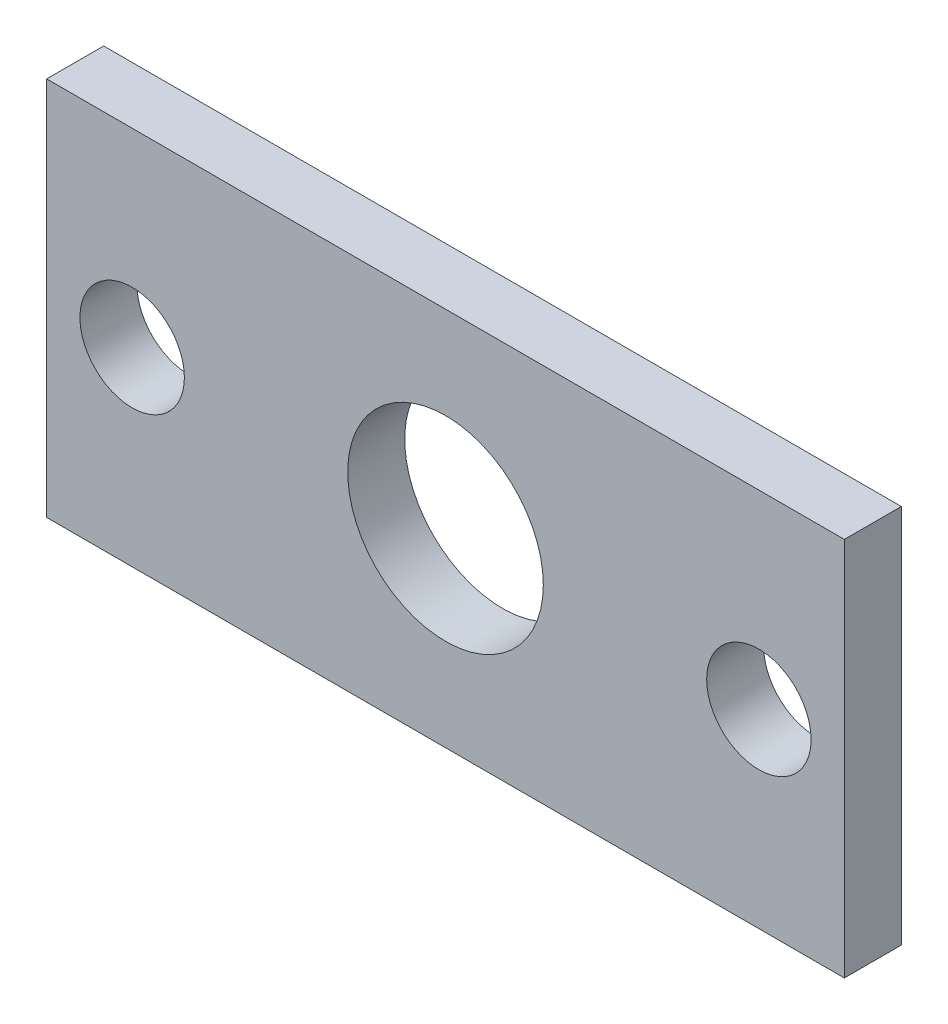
ISO-10303-21;
HEADER;
FILE_DESCRIPTION(('STEP AP214'),'2;1');
FILE_NAME('part.step','',(''),(''),'','','');
FILE_SCHEMA(('AUTOMOTIVE_DESIGN { 1 0 10303 214 1 1 1 1 }'));
ENDSEC;
DATA;
#1=APPLICATION_CONTEXT('core data for automotive mechanical design processes');
#2=APPLICATION_PROTOCOL_DEFINITION('international standard','automotive_design',2000,#1);
#3=PRODUCT_CONTEXT('',#1,'mechanical');
#4=PRODUCT('Part','Part','',(#3));
#5=PRODUCT_RELATED_PRODUCT_CATEGORY('part','',(#4));
#6=PRODUCT_DEFINITION_FORMATION('','',#4);
#7=PRODUCT_DEFINITION_CONTEXT('part definition',#1,'design');
#8=PRODUCT_DEFINITION('design','',#6,#7);
#9=PRODUCT_DEFINITION_SHAPE('','',#8);
#10=(LENGTH_UNIT() NAMED_UNIT(*) SI_UNIT(.MILLI.,.METRE.));
#11=(NAMED_UNIT(*) PLANE_ANGLE_UNIT() SI_UNIT($,.RADIAN.));
#12=(NAMED_UNIT(*) SI_UNIT($,.STERADIAN.) SOLID_ANGLE_UNIT());
#13=UNCERTAINTY_MEASURE_WITH_UNIT(LENGTH_MEASURE(1.E-05),#10,'distance_accuracy_value','');
#14=(GEOMETRIC_REPRESENTATION_CONTEXT(3) GLOBAL_UNCERTAINTY_ASSIGNED_CONTEXT((#13)) GLOBAL_UNIT_ASSIGNED_CONTEXT((#10,
#11,#12)) REPRESENTATION_CONTEXT('',''));
#15=CARTESIAN_POINT('',(0.,0.,0.));
#16=DIRECTION('',(0.,0.,1.));
#17=DIRECTION('',(1.,0.,0.));
#18=AXIS2_PLACEMENT_3D('',#15,#16,#17);
#19=CARTESIAN_POINT('',(-6.87548757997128,12.5582256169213,3.));
#20=DIRECTION('',(1.,0.,0.));
#21=DIRECTION('',(0.,1.,0.));
#22=AXIS2_PLACEMENT_3D('',#19,#20,#21);
#23=PLANE('',#22);
#24=DIRECTION('',(0.,-1.,0.));
#25=VECTOR('',#24,1.);
#26=CARTESIAN_POINT('',(-6.87548757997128,12.5582256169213,0.));
#27=LINE('',#26,#25);
#28=CARTESIAN_POINT('',(-6.87548757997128,12.5582256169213,0.));
#29=VERTEX_POINT('',#28);
#30=CARTESIAN_POINT('',(-6.87548757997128,-7.44177438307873,0.));
#31=VERTEX_POINT('',#30);
#32=EDGE_CURVE('E95',#29,#31,#27,.T.);
#33=ORIENTED_EDGE('',*,*,#32,.T.);
#34=DIRECTION('',(0.,0.,-1.));
#35=VECTOR('',#34,1.);
#36=CARTESIAN_POINT('',(-6.87548757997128,-7.44177438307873,3.));
#37=LINE('',#36,#35);
#38=CARTESIAN_POINT('',(-6.87548757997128,-7.44177438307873,3.));
#39=VERTEX_POINT('',#38);
#40=EDGE_CURVE('E11',#39,#31,#37,.T.);
#41=ORIENTED_EDGE('',*,*,#40,.F.);
#42=DIRECTION('',(0.,-1.,0.));
#43=VECTOR('',#42,1.);
#44=CARTESIAN_POINT('',(-6.87548757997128,12.5582256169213,3.));
#45=LINE('',#44,#43);
#46=CARTESIAN_POINT('',(-6.87548757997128,12.5582256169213,3.));
#47=VERTEX_POINT('',#46);
#48=EDGE_CURVE('E83',#47,#39,#45,.T.);
#49=ORIENTED_EDGE('',*,*,#48,.F.);
#50=DIRECTION('',(0.,0.,-1.));
#51=VECTOR('',#50,1.);
#52=CARTESIAN_POINT('',(-6.87548757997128,12.5582256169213,3.));
#53=LINE('',#52,#51);
#54=EDGE_CURVE('E91',#47,#29,#53,.T.);
#55=ORIENTED_EDGE('',*,*,#54,.T.);
#56=EDGE_LOOP('',(#33,#41,#49,#55));
#57=FACE_BOUND('',#56,.T.);
#58=ADVANCED_FACE('F32',(#57),#23,.F.);
#59=CARTESIAN_POINT('',(-6.87548757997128,-7.44177438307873,3.));
#60=DIRECTION('',(0.,1.,0.));
#61=DIRECTION('',(0.,0.,1.));
#62=AXIS2_PLACEMENT_3D('',#59,#60,#61);
#63=PLANE('',#62);
#64=DIRECTION('',(1.,0.,0.));
#65=VECTOR('',#64,1.);
#66=CARTESIAN_POINT('',(-6.87548757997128,-7.44177438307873,0.));
#67=LINE('',#66,#65);
#68=CARTESIAN_POINT('',(35.1245124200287,-7.44177438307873,0.));
#69=VERTEX_POINT('',#68);
#70=EDGE_CURVE('E87',#31,#69,#67,.T.);
#71=ORIENTED_EDGE('',*,*,#70,.T.);
#72=DIRECTION('',(0.,0.,-1.));
#73=VECTOR('',#72,1.);
#74=CARTESIAN_POINT('',(35.1245124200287,-7.44177438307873,3.));
#75=LINE('',#74,#73);
#76=CARTESIAN_POINT('',(35.1245124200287,-7.44177438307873,3.));
#77=VERTEX_POINT('',#76);
#78=EDGE_CURVE('E40',#77,#69,#75,.T.);
#79=ORIENTED_EDGE('',*,*,#78,.F.);
#80=DIRECTION('',(1.,0.,0.));
#81=VECTOR('',#80,1.);
#82=CARTESIAN_POINT('',(-6.87548757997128,-7.44177438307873,3.));
#83=LINE('',#82,#81);
#84=EDGE_CURVE('E78',#39,#77,#83,.T.);
#85=ORIENTED_EDGE('',*,*,#84,.F.);
#86=ORIENTED_EDGE('',*,*,#40,.T.);
#87=EDGE_LOOP('',(#71,#79,#85,#86));
#88=FACE_BOUND('',#87,.T.);
#89=ADVANCED_FACE('F86',(#88),#63,.F.);
#90=CARTESIAN_POINT('',(35.1245124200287,12.5582256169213,3.));
#91=DIRECTION('',(-1.,0.,0.));
#92=DIRECTION('',(0.,-1.,0.));
#93=AXIS2_PLACEMENT_3D('',#90,#91,#92);
#94=PLANE('',#93);
#95=DIRECTION('',(0.,1.,0.));
#96=VECTOR('',#95,1.);
#97=CARTESIAN_POINT('',(35.1245124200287,12.5582256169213,0.));
#98=LINE('',#97,#96);
#99=CARTESIAN_POINT('',(35.1245124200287,12.5582256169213,0.));
#100=VERTEX_POINT('',#99);
#101=EDGE_CURVE('E65',#69,#100,#98,.T.);
#102=ORIENTED_EDGE('',*,*,#101,.T.);
#103=DIRECTION('',(0.,0.,-1.));
#104=VECTOR('',#103,1.);
#105=CARTESIAN_POINT('',(35.1245124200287,12.5582256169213,3.));
#106=LINE('',#105,#104);
#107=CARTESIAN_POINT('',(35.1245124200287,12.5582256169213,3.));
#108=VERTEX_POINT('',#107);
#109=EDGE_CURVE('E88',#108,#100,#106,.T.);
#110=ORIENTED_EDGE('',*,*,#109,.F.);
#111=DIRECTION('',(0.,1.,0.));
#112=VECTOR('',#111,1.);
#113=CARTESIAN_POINT('',(35.1245124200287,12.5582256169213,3.));
#114=LINE('',#113,#112);
#115=EDGE_CURVE('E81',#77,#108,#114,.T.);
#116=ORIENTED_EDGE('',*,*,#115,.F.);
#117=ORIENTED_EDGE('',*,*,#78,.T.);
#118=EDGE_LOOP('',(#102,#110,#116,#117));
#119=FACE_BOUND('',#118,.T.);
#120=ADVANCED_FACE('F89',(#119),#94,.F.);
#121=CARTESIAN_POINT('',(-6.87548757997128,12.5582256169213,3.));
#122=DIRECTION('',(0.,-1.,0.));
#123=DIRECTION('',(0.,0.,-1.));
#124=AXIS2_PLACEMENT_3D('',#121,#122,#123);
#125=PLANE('',#124);
#126=DIRECTION('',(-1.,0.,0.));
#127=VECTOR('',#126,1.);
#128=CARTESIAN_POINT('',(-6.87548757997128,12.5582256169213,0.));
#129=LINE('',#128,#127);
#130=EDGE_CURVE('E71',#100,#29,#129,.T.);
#131=ORIENTED_EDGE('',*,*,#130,.T.);
#132=ORIENTED_EDGE('',*,*,#54,.F.);
#133=DIRECTION('',(-1.,0.,0.));
#134=VECTOR('',#133,1.);
#135=CARTESIAN_POINT('',(-6.87548757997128,12.5582256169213,3.));
#136=LINE('',#135,#134);
#137=EDGE_CURVE('E48',#108,#47,#136,.T.);
#138=ORIENTED_EDGE('',*,*,#137,.F.);
#139=ORIENTED_EDGE('',*,*,#109,.T.);
#140=EDGE_LOOP('',(#131,#132,#138,#139));
#141=FACE_BOUND('',#140,.T.);
#142=ADVANCED_FACE('F103',(#141),#125,.F.);
#143=CARTESIAN_POINT('',(-6.87548757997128,-7.44177438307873,3.));
#144=DIRECTION('',(0.,0.,1.));
#145=DIRECTION('',(1.,0.,0.));
#146=AXIS2_PLACEMENT_3D('',#143,#144,#145);
#147=PLANE('',#146);
#148=CARTESIAN_POINT('',(14.1245124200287,2.55822561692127,3.));
#149=DIRECTION('',(0.,0.,1.));
#150=DIRECTION('',(1.,0.,0.));
#151=AXIS2_PLACEMENT_3D('',#148,#149,#150);
#152=CIRCLE('',#151,5.15);
#153=CARTESIAN_POINT('',(19.2745124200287,2.55822561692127,3.));
#154=VERTEX_POINT('',#153);
#155=EDGE_CURVE('E121',#154,#154,#152,.T.);
#156=ORIENTED_EDGE('',*,*,#155,.F.);
#157=EDGE_LOOP('',(#156));
#158=FACE_BOUND('',#157,.T.);
#159=CARTESIAN_POINT('',(30.6245124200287,2.55822561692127,3.));
#160=DIRECTION('',(0.,0.,1.));
#161=DIRECTION('',(-1.,0.,0.));
#162=AXIS2_PLACEMENT_3D('',#159,#160,#161);
#163=CIRCLE('',#162,2.75);
#164=CARTESIAN_POINT('',(27.8745124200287,2.55822561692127,3.));
#165=VERTEX_POINT('',#164);
#166=EDGE_CURVE('E115',#165,#165,#163,.T.);
#167=ORIENTED_EDGE('',*,*,#166,.F.);
#168=EDGE_LOOP('',(#167));
#169=FACE_BOUND('',#168,.T.);
#170=CARTESIAN_POINT('',(-2.37548757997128,2.55822561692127,3.));
#171=DIRECTION('',(0.,0.,1.));
#172=DIRECTION('',(1.,0.,0.));
#173=AXIS2_PLACEMENT_3D('',#170,#171,#172);
#174=CIRCLE('',#173,2.75);
#175=CARTESIAN_POINT('',(0.374512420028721,2.55822561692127,3.));
#176=VERTEX_POINT('',#175);
#177=EDGE_CURVE('E109',#176,#176,#174,.T.);
#178=ORIENTED_EDGE('',*,*,#177,.F.);
#179=EDGE_LOOP('',(#178));
#180=FACE_BOUND('',#179,.T.);
#181=ORIENTED_EDGE('',*,*,#48,.T.);
#182=ORIENTED_EDGE('',*,*,#84,.T.);
#183=ORIENTED_EDGE('',*,*,#115,.T.);
#184=ORIENTED_EDGE('',*,*,#137,.T.);
#185=EDGE_LOOP('',(#181,#182,#183,#184));
#186=FACE_BOUND('',#185,.T.);
#187=ADVANCED_FACE('F79',(#158,#169,#180,#186),#147,.T.);
#188=CARTESIAN_POINT('',(-6.87548757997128,-7.44177438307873,0.));
#189=DIRECTION('',(0.,0.,1.));
#190=DIRECTION('',(1.,0.,0.));
#191=AXIS2_PLACEMENT_3D('',#188,#189,#190);
#192=PLANE('',#191);
#193=CARTESIAN_POINT('',(14.1245124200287,2.55822561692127,0.));
#194=DIRECTION('',(0.,0.,1.));
#195=DIRECTION('',(1.,0.,0.));
#196=AXIS2_PLACEMENT_3D('',#193,#194,#195);
#197=CIRCLE('',#196,5.15);
#198=CARTESIAN_POINT('',(19.2745124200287,2.55822561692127,0.));
#199=VERTEX_POINT('',#198);
#200=EDGE_CURVE('E118',#199,#199,#197,.T.);
#201=ORIENTED_EDGE('',*,*,#200,.T.);
#202=EDGE_LOOP('',(#201));
#203=FACE_BOUND('',#202,.T.);
#204=CARTESIAN_POINT('',(30.6245124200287,2.55822561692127,0.));
#205=DIRECTION('',(0.,0.,1.));
#206=DIRECTION('',(-1.,0.,0.));
#207=AXIS2_PLACEMENT_3D('',#204,#205,#206);
#208=CIRCLE('',#207,2.75);
#209=CARTESIAN_POINT('',(27.8745124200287,2.55822561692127,0.));
#210=VERTEX_POINT('',#209);
#211=EDGE_CURVE('E112',#210,#210,#208,.T.);
#212=ORIENTED_EDGE('',*,*,#211,.T.);
#213=EDGE_LOOP('',(#212));
#214=FACE_BOUND('',#213,.T.);
#215=CARTESIAN_POINT('',(-2.37548757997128,2.55822561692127,0.));
#216=DIRECTION('',(0.,0.,1.));
#217=DIRECTION('',(1.,0.,0.));
#218=AXIS2_PLACEMENT_3D('',#215,#216,#217);
#219=CIRCLE('',#218,2.75);
#220=CARTESIAN_POINT('',(0.374512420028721,2.55822561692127,0.));
#221=VERTEX_POINT('',#220);
#222=EDGE_CURVE('E98',#221,#221,#219,.T.);
#223=ORIENTED_EDGE('',*,*,#222,.T.);
#224=EDGE_LOOP('',(#223));
#225=FACE_BOUND('',#224,.T.);
#226=ORIENTED_EDGE('',*,*,#32,.F.);
#227=ORIENTED_EDGE('',*,*,#130,.F.);
#228=ORIENTED_EDGE('',*,*,#101,.F.);
#229=ORIENTED_EDGE('',*,*,#70,.F.);
#230=EDGE_LOOP('',(#226,#227,#228,#229));
#231=FACE_BOUND('',#230,.T.);
#232=ADVANCED_FACE('F106',(#203,#214,#225,#231),#192,.F.);
#233=CARTESIAN_POINT('',(-2.37548757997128,2.55822561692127,0.));
#234=DIRECTION('',(0.,0.,1.));
#235=DIRECTION('',(1.,0.,0.));
#236=AXIS2_PLACEMENT_3D('',#233,#234,#235);
#237=CYLINDRICAL_SURFACE('',#236,2.75);
#238=ORIENTED_EDGE('',*,*,#222,.F.);
#239=EDGE_LOOP('',(#238));
#240=FACE_BOUND('',#239,.T.);
#241=ORIENTED_EDGE('',*,*,#177,.T.);
#242=EDGE_LOOP('',(#241));
#243=FACE_BOUND('',#242,.T.);
#244=ADVANCED_FACE('F143',(#240,#243),#237,.F.);
#245=CARTESIAN_POINT('',(30.6245124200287,2.55822561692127,0.));
#246=DIRECTION('',(0.,0.,1.));
#247=DIRECTION('',(1.,0.,0.));
#248=AXIS2_PLACEMENT_3D('',#245,#246,#247);
#249=CYLINDRICAL_SURFACE('',#248,2.75);
#250=ORIENTED_EDGE('',*,*,#211,.F.);
#251=EDGE_LOOP('',(#250));
#252=FACE_BOUND('',#251,.T.);
#253=ORIENTED_EDGE('',*,*,#166,.T.);
#254=EDGE_LOOP('',(#253));
#255=FACE_BOUND('',#254,.T.);
#256=ADVANCED_FACE('F132',(#252,#255),#249,.F.);
#257=CARTESIAN_POINT('',(14.1245124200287,2.55822561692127,0.));
#258=DIRECTION('',(0.,0.,1.));
#259=DIRECTION('',(1.,0.,0.));
#260=AXIS2_PLACEMENT_3D('',#257,#258,#259);
#261=CYLINDRICAL_SURFACE('',#260,5.15);
#262=ORIENTED_EDGE('',*,*,#200,.F.);
#263=EDGE_LOOP('',(#262));
#264=FACE_BOUND('',#263,.T.);
#265=ORIENTED_EDGE('',*,*,#155,.T.);
#266=EDGE_LOOP('',(#265));
#267=FACE_BOUND('',#266,.T.);
#268=ADVANCED_FACE('F129',(#264,#267),#261,.F.);
#269=CLOSED_SHELL('',(#58,#89,#120,#142,#187,#232,#244,#256,#268));
#270=MANIFOLD_SOLID_BREP('B2',#269);
#271=ADVANCED_BREP_SHAPE_REPRESENTATION('',(#18,#270),#14);
#272=SHAPE_DEFINITION_REPRESENTATION(#9,#271);
ENDSEC;
END-ISO-10303-21;
